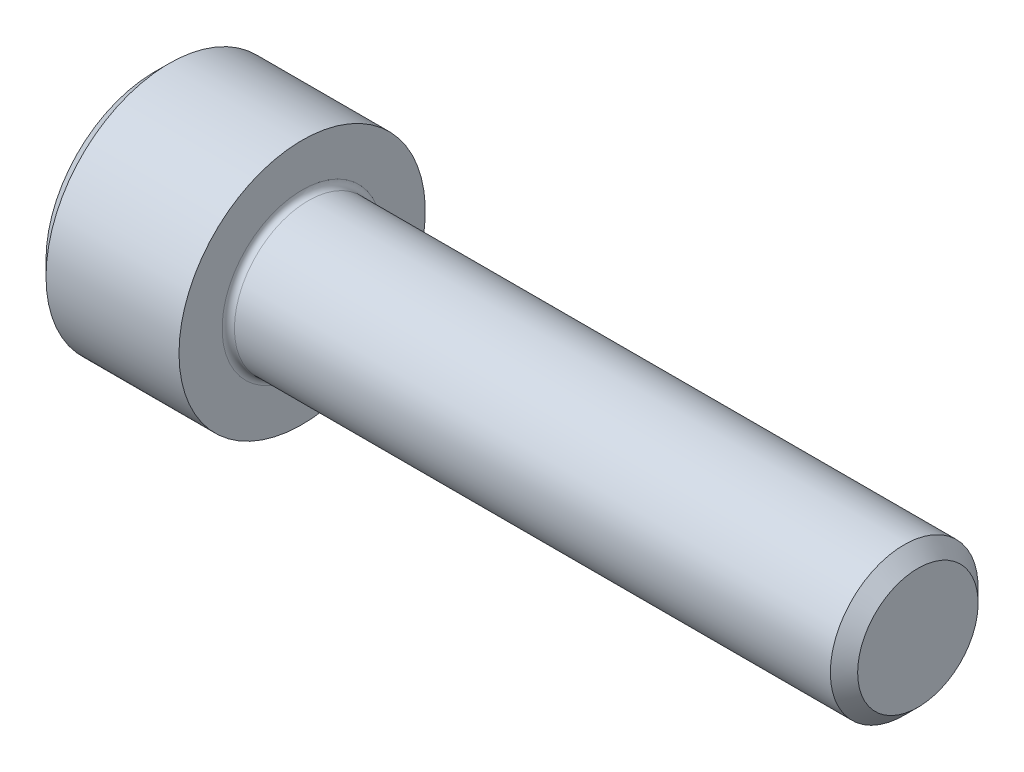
from build123d import *

# Parameters (mm, degrees)
FILLET1_R   = 0.25
HEX_2_DEPTH = 3


with BuildPart() as part:
    # BodySke → Base-Revolve (revolve)
    with BuildSketch(Plane.XY, mode=Mode.PRIVATE) as base_revolve_sk:
        Polygon((0, 0), (0, 4.4), (0.6, 5), (6, 5), (6, 3), (30.4455, 3), (31, 2.4455), (31, 0), align=None)
    revolve(base_revolve_sk.sketch.rotate(Axis((-31.75, 0, 0), (1, 0, 0)), 90), axis=Axis((-31.75, 0, 0), (1, 0, 0)))

    # Fillet1
    fillet1_edges = [part.edges().sort_by_distance(p)[0] for p in [
        (6, 0, -3),
    ]]
    fillet(fillet1_edges, radius=FILLET1_R)

    # Sketch2 → Hex-PreBroach (revolve, cut)
    with BuildSketch(Plane.XY, mode=Mode.PRIVATE) as hex_prebroach_sk:
        Polygon((0, 2.542), (3, 2.542), (4.467624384, 0), (0, 0), align=None)
    revolve(hex_prebroach_sk.sketch.rotate(Axis((0, 0, 0), (1, 0, 0)), 90), axis=Axis((0, 0, 0), (1, 0, 0)), mode=Mode.SUBTRACT)

    # Sketch3 → Hex 2 (cut)
    with BuildSketch(Plane(origin=(0, 0, 0), x_dir=(0, 0.500000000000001, 0.866025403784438), z_dir=(-1, 0, 0))):
        Polygon((1.467624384, 2.542), (-1.467624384, 2.542), (-2.935248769, 0), (-1.467624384, -2.542), (1.467624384, -2.542), (2.935248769, 0), align=None)
    extrude(amount=-HEX_2_DEPTH, mode=Mode.SUBTRACT)


solid = part.part
